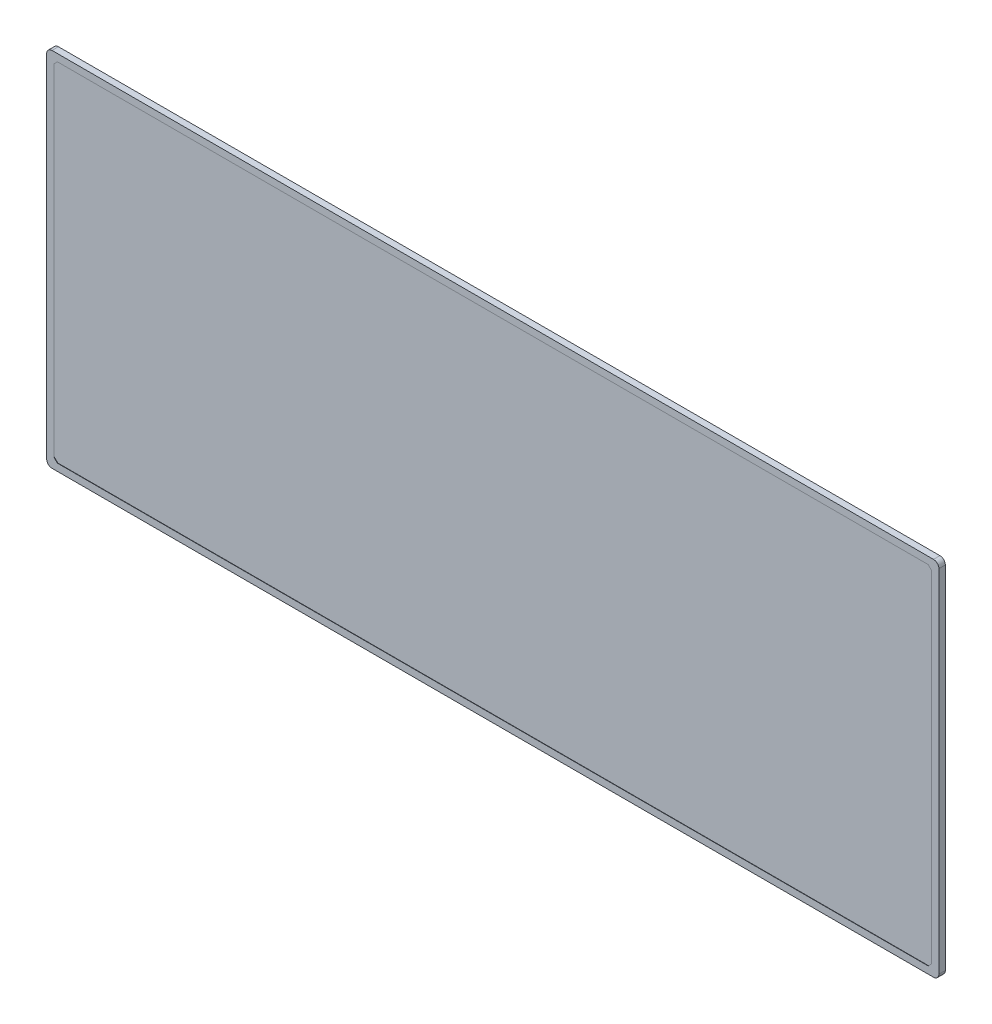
from build123d import *

# Parameters (mm, degrees)
SKETCH2_W           = 2455
SKETCH2_H           = 972
BOSS_EXTRUDE1_DEPTH = 17
SKETCH3_W           = 2495
SKETCH3_H           = 1012
SKETCH3_W_2         = 2455
SKETCH3_H_2         = 972
BOSS_EXTRUDE2_DEPTH = 18
FILLET1_R           = 15
CHAMFER1_SIZE       = 10


with BuildPart() as part:
    # Sketch2 → Boss-Extrude1 (new body)
    with BuildSketch(Plane.XY):
        Rectangle(SKETCH2_W, SKETCH2_H)
    extrude(amount=BOSS_EXTRUDE1_DEPTH)

    # Sketch3 → Boss-Extrude2 (add)
    with BuildSketch(Plane(origin=(0, 0, 0), x_dir=(-1, 0, 0), z_dir=(0, 0, -1))):
        Rectangle(SKETCH3_W, SKETCH3_H)
        Rectangle(SKETCH3_W_2, SKETCH3_H_2, mode=Mode.SUBTRACT)
    extrude(amount=-BOSS_EXTRUDE2_DEPTH)

    # Fillet1
    fillet1_edges = [part.edges().sort_by_distance(p)[0] for p in [
        (-1247.5, 506, 9),
        (-1247.5, -506, 9),
        (1247.5, -506, 9),
        (1247.5, 506, 9),
    ]]
    fillet(fillet1_edges, radius=FILLET1_R)

    # Chamfer1
    chamfer1_edges = [part.edges().sort_by_distance(p)[0] for p in [
        (1227.5, -486, 17.5),
        (1227.5, 486, 17.5),
        (-1227.5, 486, 17.5),
        (-1227.5, -486, 17.5),
    ]]
    chamfer(chamfer1_edges, length=CHAMFER1_SIZE)


solid = part.part
